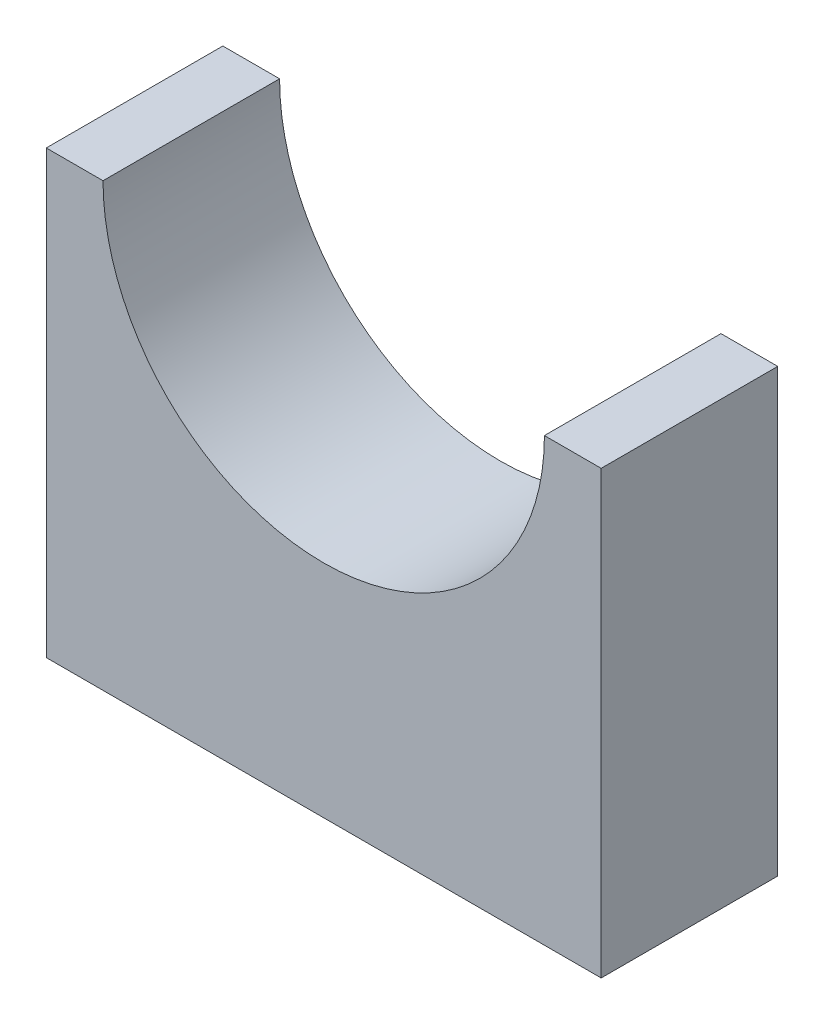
from build123d import *

# Parameters (mm, degrees)
BOSS_EXTRUDE1_DEPTH = 4


with BuildPart() as part:
    # Sketch1 → Boss-Extrude1 (new body)
    with BuildSketch(Plane.XY):
        with BuildLine():
            Line((5.142498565, 6.247537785), (6.428268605, 6.247537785))
            Line((6.428268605, 6.247537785), (6.428268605, -3.752462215))
            Line((6.428268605, -3.752462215), (-6.143271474, -3.752462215))
            Line((-6.143271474, -3.752462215), (-6.143271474, 6.247537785))
            Line((-6.143271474, 6.247537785), (-4.857501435, 6.247537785))
            ThreePointArc((-4.857501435, 6.247537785), (0.142498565, 1.247537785), (5.142498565, 6.247537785))
        make_face()
    extrude(amount=BOSS_EXTRUDE1_DEPTH)


solid = part.part
